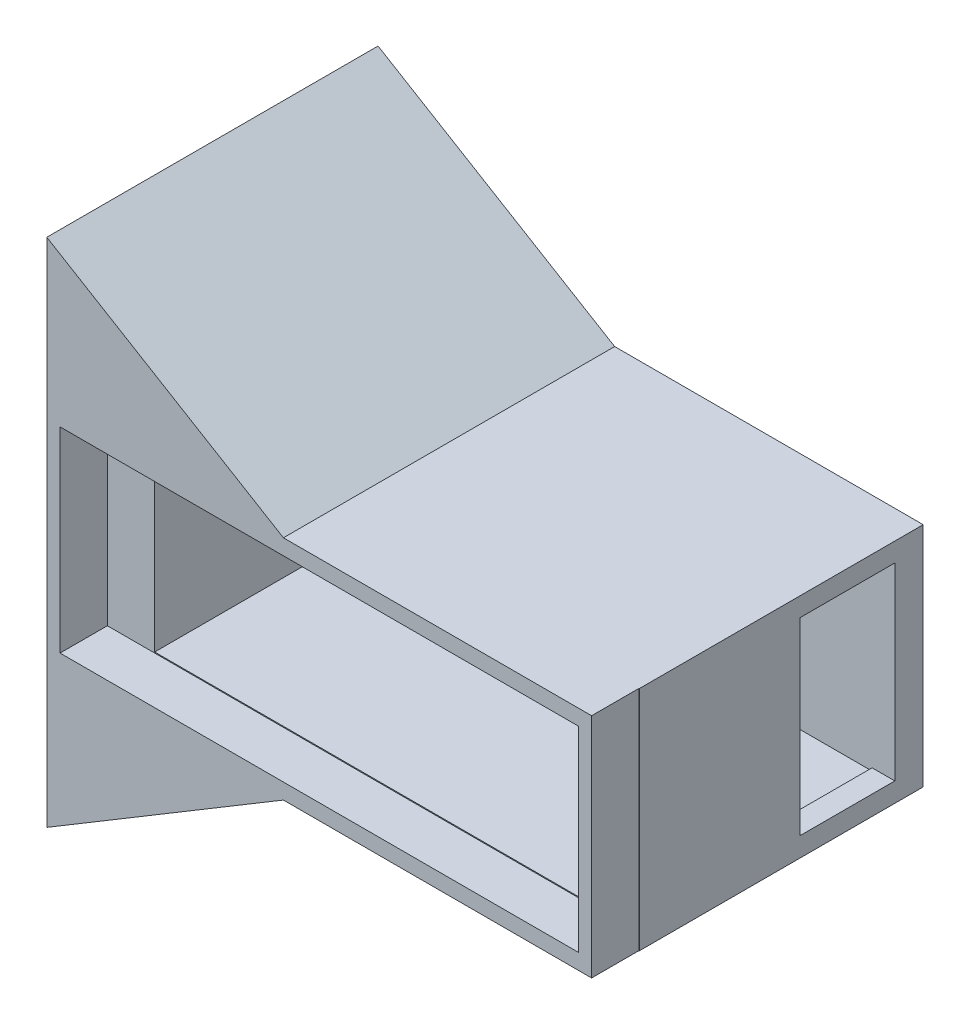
ISO-10303-21;
HEADER;
FILE_DESCRIPTION(('STEP AP214'),'2;1');
FILE_NAME('part.step','',(''),(''),'','','');
FILE_SCHEMA(('AUTOMOTIVE_DESIGN { 1 0 10303 214 1 1 1 1 }'));
ENDSEC;
DATA;
#1=APPLICATION_CONTEXT('core data for automotive mechanical design processes');
#2=APPLICATION_PROTOCOL_DEFINITION('international standard','automotive_design',2000,#1);
#3=PRODUCT_CONTEXT('',#1,'mechanical');
#4=PRODUCT('Part','Part','',(#3));
#5=PRODUCT_RELATED_PRODUCT_CATEGORY('part','',(#4));
#6=PRODUCT_DEFINITION_FORMATION('','',#4);
#7=PRODUCT_DEFINITION_CONTEXT('part definition',#1,'design');
#8=PRODUCT_DEFINITION('design','',#6,#7);
#9=PRODUCT_DEFINITION_SHAPE('','',#8);
#10=(LENGTH_UNIT() NAMED_UNIT(*) SI_UNIT(.MILLI.,.METRE.));
#11=(NAMED_UNIT(*) PLANE_ANGLE_UNIT() SI_UNIT($,.RADIAN.));
#12=(NAMED_UNIT(*) SI_UNIT($,.STERADIAN.) SOLID_ANGLE_UNIT());
#13=UNCERTAINTY_MEASURE_WITH_UNIT(LENGTH_MEASURE(1.E-05),#10,'distance_accuracy_value','');
#14=(GEOMETRIC_REPRESENTATION_CONTEXT(3) GLOBAL_UNCERTAINTY_ASSIGNED_CONTEXT((#13)) GLOBAL_UNIT_ASSIGNED_CONTEXT((#10,
#11,#12)) REPRESENTATION_CONTEXT('',''));
#15=CARTESIAN_POINT('',(0.,0.,0.));
#16=DIRECTION('',(0.,0.,1.));
#17=DIRECTION('',(1.,0.,0.));
#18=AXIS2_PLACEMENT_3D('',#15,#16,#17);
#19=CARTESIAN_POINT('',(-28.8,12.,30.));
#20=DIRECTION('',(0.,-1.,0.));
#21=DIRECTION('',(1.,0.,0.));
#22=AXIS2_PLACEMENT_3D('',#19,#20,#21);
#23=PLANE('',#22);
#24=DIRECTION('',(0.,0.,-1.));
#25=VECTOR('',#24,1.);
#26=CARTESIAN_POINT('',(-3.8,12.,35.));
#27=LINE('',#26,#25);
#28=CARTESIAN_POINT('',(-3.8,12.,35.));
#29=VERTEX_POINT('',#28);
#30=CARTESIAN_POINT('',(-3.8,12.,0.));
#31=VERTEX_POINT('',#30);
#32=EDGE_CURVE('E60',#29,#31,#27,.T.);
#33=ORIENTED_EDGE('',*,*,#32,.F.);
#34=DIRECTION('',(-1.,0.,0.));
#35=VECTOR('',#34,1.);
#36=CARTESIAN_POINT('',(-28.8,12.,35.));
#37=LINE('',#36,#35);
#38=CARTESIAN_POINT('',(28.7632477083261,12.,35.));
#39=VERTEX_POINT('',#38);
#40=EDGE_CURVE('E194',#39,#29,#37,.T.);
#41=ORIENTED_EDGE('',*,*,#40,.F.);
#42=DIRECTION('',(0.,0.,-1.));
#43=VECTOR('',#42,1.);
#44=CARTESIAN_POINT('',(28.7632477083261,12.,35.));
#45=LINE('',#44,#43);
#46=CARTESIAN_POINT('',(28.7632477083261,12.,30.));
#47=VERTEX_POINT('',#46);
#48=EDGE_CURVE('E324',#39,#47,#45,.T.);
#49=ORIENTED_EDGE('',*,*,#48,.T.);
#50=DIRECTION('',(-1.,0.,0.));
#51=VECTOR('',#50,1.);
#52=CARTESIAN_POINT('',(-28.8,12.,30.));
#53=LINE('',#52,#51);
#54=CARTESIAN_POINT('',(28.8,12.,30.));
#55=VERTEX_POINT('',#54);
#56=EDGE_CURVE('E370',#55,#47,#53,.T.);
#57=ORIENTED_EDGE('',*,*,#56,.F.);
#58=DIRECTION('',(0.,0.,-1.));
#59=VECTOR('',#58,1.);
#60=CARTESIAN_POINT('',(28.8,12.,30.));
#61=LINE('',#60,#59);
#62=CARTESIAN_POINT('',(28.8,12.,0.));
#63=VERTEX_POINT('',#62);
#64=EDGE_CURVE('E53',#55,#63,#61,.T.);
#65=ORIENTED_EDGE('',*,*,#64,.T.);
#66=DIRECTION('',(-1.,0.,0.));
#67=VECTOR('',#66,1.);
#68=CARTESIAN_POINT('',(-28.8,12.,0.));
#69=LINE('',#68,#67);
#70=EDGE_CURVE('E381',#63,#31,#69,.T.);
#71=ORIENTED_EDGE('',*,*,#70,.T.);
#72=EDGE_LOOP('',(#33,#41,#49,#57,#65,#71));
#73=FACE_BOUND('',#72,.T.);
#74=ADVANCED_FACE('F44',(#73),#23,.F.);
#75=CARTESIAN_POINT('',(0.0882889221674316,-9.94817546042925,3.));
#76=DIRECTION('',(0.,-1.,0.));
#77=DIRECTION('',(1.,0.,0.));
#78=AXIS2_PLACEMENT_3D('',#75,#76,#77);
#79=PLANE('',#78);
#80=DIRECTION('',(0.,0.,-1.));
#81=VECTOR('',#80,1.);
#82=CARTESIAN_POINT('',(26.4,-9.94817546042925,3.));
#83=LINE('',#82,#81);
#84=CARTESIAN_POINT('',(26.4,-9.94817546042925,13.));
#85=VERTEX_POINT('',#84);
#86=CARTESIAN_POINT('',(26.4,-9.94817546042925,3.));
#87=VERTEX_POINT('',#86);
#88=EDGE_CURVE('E241',#85,#87,#83,.T.);
#89=ORIENTED_EDGE('',*,*,#88,.F.);
#90=DIRECTION('',(1.,0.,0.));
#91=VECTOR('',#90,1.);
#92=CARTESIAN_POINT('',(0.0882889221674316,-9.94817546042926,13.));
#93=LINE('',#92,#91);
#94=CARTESIAN_POINT('',(28.8,-9.94817546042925,13.));
#95=VERTEX_POINT('',#94);
#96=EDGE_CURVE('E261',#85,#95,#93,.T.);
#97=ORIENTED_EDGE('',*,*,#96,.T.);
#98=DIRECTION('',(0.,0.,-1.));
#99=VECTOR('',#98,1.);
#100=CARTESIAN_POINT('',(28.8,-9.94817546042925,3.));
#101=LINE('',#100,#99);
#102=CARTESIAN_POINT('',(28.8,-9.94817546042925,3.));
#103=VERTEX_POINT('',#102);
#104=EDGE_CURVE('E244',#95,#103,#101,.T.);
#105=ORIENTED_EDGE('',*,*,#104,.T.);
#106=DIRECTION('',(1.,0.,0.));
#107=VECTOR('',#106,1.);
#108=CARTESIAN_POINT('',(0.0882889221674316,-9.94817546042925,3.));
#109=LINE('',#108,#107);
#110=EDGE_CURVE('E260',#87,#103,#109,.T.);
#111=ORIENTED_EDGE('',*,*,#110,.F.);
#112=EDGE_LOOP('',(#89,#97,#105,#111));
#113=FACE_BOUND('',#112,.T.);
#114=ADVANCED_FACE('F425',(#113),#79,.F.);
#115=CARTESIAN_POINT('',(0.0882889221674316,-9.94817546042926,13.));
#116=DIRECTION('',(0.,0.,1.));
#117=DIRECTION('',(1.,0.,0.));
#118=AXIS2_PLACEMENT_3D('',#115,#116,#117);
#119=PLANE('',#118);
#120=DIRECTION('',(0.,-1.,0.));
#121=VECTOR('',#120,1.);
#122=CARTESIAN_POINT('',(26.4,-9.94817546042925,13.));
#123=LINE('',#122,#121);
#124=CARTESIAN_POINT('',(26.4,9.99706084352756,13.));
#125=VERTEX_POINT('',#124);
#126=EDGE_CURVE('E235',#125,#85,#123,.T.);
#127=ORIENTED_EDGE('',*,*,#126,.F.);
#128=DIRECTION('',(1.,0.,0.));
#129=VECTOR('',#128,1.);
#130=CARTESIAN_POINT('',(0.0882889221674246,9.99706084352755,13.));
#131=LINE('',#130,#129);
#132=CARTESIAN_POINT('',(28.8,9.99706084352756,13.));
#133=VERTEX_POINT('',#132);
#134=EDGE_CURVE('E265',#125,#133,#131,.T.);
#135=ORIENTED_EDGE('',*,*,#134,.T.);
#136=DIRECTION('',(0.,-1.,0.));
#137=VECTOR('',#136,1.);
#138=CARTESIAN_POINT('',(28.8,-9.94817546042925,13.));
#139=LINE('',#138,#137);
#140=EDGE_CURVE('E256',#133,#95,#139,.T.);
#141=ORIENTED_EDGE('',*,*,#140,.T.);
#142=ORIENTED_EDGE('',*,*,#96,.F.);
#143=EDGE_LOOP('',(#127,#135,#141,#142));
#144=FACE_BOUND('',#143,.T.);
#145=ADVANCED_FACE('F431',(#144),#119,.F.);
#146=CARTESIAN_POINT('',(0.0882889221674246,9.99706084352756,3.));
#147=DIRECTION('',(0.,1.,0.));
#148=DIRECTION('',(0.,0.,1.));
#149=AXIS2_PLACEMENT_3D('',#146,#147,#148);
#150=PLANE('',#149);
#151=DIRECTION('',(0.,0.,1.));
#152=VECTOR('',#151,1.);
#153=CARTESIAN_POINT('',(26.4,9.99706084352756,3.));
#154=LINE('',#153,#152);
#155=CARTESIAN_POINT('',(26.4,9.99706084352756,3.));
#156=VERTEX_POINT('',#155);
#157=EDGE_CURVE('E11',#156,#125,#154,.T.);
#158=ORIENTED_EDGE('',*,*,#157,.F.);
#159=DIRECTION('',(1.,0.,0.));
#160=VECTOR('',#159,1.);
#161=CARTESIAN_POINT('',(0.0882889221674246,9.99706084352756,3.));
#162=LINE('',#161,#160);
#163=CARTESIAN_POINT('',(28.8,9.99706084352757,3.));
#164=VERTEX_POINT('',#163);
#165=EDGE_CURVE('E268',#156,#164,#162,.T.);
#166=ORIENTED_EDGE('',*,*,#165,.T.);
#167=DIRECTION('',(0.,0.,1.));
#168=VECTOR('',#167,1.);
#169=CARTESIAN_POINT('',(28.8,9.99706084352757,3.));
#170=LINE('',#169,#168);
#171=EDGE_CURVE('E252',#164,#133,#170,.T.);
#172=ORIENTED_EDGE('',*,*,#171,.T.);
#173=ORIENTED_EDGE('',*,*,#134,.F.);
#174=EDGE_LOOP('',(#158,#166,#172,#173));
#175=FACE_BOUND('',#174,.T.);
#176=ADVANCED_FACE('F438',(#175),#150,.F.);
#177=CARTESIAN_POINT('',(28.8,12.,30.));
#178=DIRECTION('',(-1.,0.,0.));
#179=DIRECTION('',(0.,-1.,0.));
#180=AXIS2_PLACEMENT_3D('',#177,#178,#179);
#181=PLANE('',#180);
#182=DIRECTION('',(0.,1.,0.));
#183=VECTOR('',#182,1.);
#184=CARTESIAN_POINT('',(28.8,-0.00293915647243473,3.));
#185=LINE('',#184,#183);
#186=EDGE_CURVE('E248',#103,#164,#185,.T.);
#187=ORIENTED_EDGE('',*,*,#186,.F.);
#188=ORIENTED_EDGE('',*,*,#104,.F.);
#189=ORIENTED_EDGE('',*,*,#140,.F.);
#190=ORIENTED_EDGE('',*,*,#171,.F.);
#191=EDGE_LOOP('',(#187,#188,#189,#190));
#192=FACE_BOUND('',#191,.T.);
#193=DIRECTION('',(0.,1.,0.));
#194=VECTOR('',#193,1.);
#195=CARTESIAN_POINT('',(28.8,12.,0.));
#196=LINE('',#195,#194);
#197=CARTESIAN_POINT('',(28.8,-12.,0.));
#198=VERTEX_POINT('',#197);
#199=EDGE_CURVE('E362',#198,#63,#196,.T.);
#200=ORIENTED_EDGE('',*,*,#199,.T.);
#201=ORIENTED_EDGE('',*,*,#64,.F.);
#202=DIRECTION('',(0.,1.,0.));
#203=VECTOR('',#202,1.);
#204=CARTESIAN_POINT('',(28.8,12.,30.));
#205=LINE('',#204,#203);
#206=CARTESIAN_POINT('',(28.8,-12.,30.));
#207=VERTEX_POINT('',#206);
#208=EDGE_CURVE('E366',#207,#55,#205,.T.);
#209=ORIENTED_EDGE('',*,*,#208,.F.);
#210=DIRECTION('',(0.,0.,-1.));
#211=VECTOR('',#210,1.);
#212=CARTESIAN_POINT('',(28.8,-12.,30.));
#213=LINE('',#212,#211);
#214=EDGE_CURVE('E377',#207,#198,#213,.T.);
#215=ORIENTED_EDGE('',*,*,#214,.T.);
#216=EDGE_LOOP('',(#200,#201,#209,#215));
#217=FACE_BOUND('',#216,.T.);
#218=ADVANCED_FACE('F46',(#192,#217),#181,.F.);
#219=CARTESIAN_POINT('',(-28.8,12.,30.));
#220=DIRECTION('',(1.,0.,0.));
#221=DIRECTION('',(0.,0.,-1.));
#222=AXIS2_PLACEMENT_3D('',#219,#220,#221);
#223=PLANE('',#222);
#224=DIRECTION('',(0.,-1.,0.));
#225=VECTOR('',#224,1.);
#226=CARTESIAN_POINT('',(-28.8,12.,0.));
#227=LINE('',#226,#225);
#228=CARTESIAN_POINT('',(-28.8,27.,0.));
#229=VERTEX_POINT('',#228);
#230=CARTESIAN_POINT('',(-28.8,-27.,0.));
#231=VERTEX_POINT('',#230);
#232=EDGE_CURVE('E384',#229,#231,#227,.T.);
#233=ORIENTED_EDGE('',*,*,#232,.T.);
#234=DIRECTION('',(0.,0.,-1.));
#235=VECTOR('',#234,1.);
#236=CARTESIAN_POINT('',(-28.8,-27.,35.));
#237=LINE('',#236,#235);
#238=CARTESIAN_POINT('',(-28.8,-27.,35.));
#239=VERTEX_POINT('',#238);
#240=EDGE_CURVE('E189',#239,#231,#237,.T.);
#241=ORIENTED_EDGE('',*,*,#240,.F.);
#242=DIRECTION('',(0.,-1.,0.));
#243=VECTOR('',#242,1.);
#244=CARTESIAN_POINT('',(-28.8,12.,35.));
#245=LINE('',#244,#243);
#246=CARTESIAN_POINT('',(-28.8,27.,35.));
#247=VERTEX_POINT('',#246);
#248=EDGE_CURVE('E184',#247,#239,#245,.T.);
#249=ORIENTED_EDGE('',*,*,#248,.F.);
#250=DIRECTION('',(0.,0.,-1.));
#251=VECTOR('',#250,1.);
#252=CARTESIAN_POINT('',(-28.8,27.,35.));
#253=LINE('',#252,#251);
#254=EDGE_CURVE('E188',#247,#229,#253,.T.);
#255=ORIENTED_EDGE('',*,*,#254,.T.);
#256=EDGE_LOOP('',(#233,#241,#249,#255));
#257=FACE_BOUND('',#256,.T.);
#258=ADVANCED_FACE('F186',(#257),#223,.F.);
#259=CARTESIAN_POINT('',(-28.8,-12.,30.));
#260=DIRECTION('',(0.,1.,0.));
#261=DIRECTION('',(0.,0.,1.));
#262=AXIS2_PLACEMENT_3D('',#259,#260,#261);
#263=PLANE('',#262);
#264=DIRECTION('',(1.,0.,0.));
#265=VECTOR('',#264,1.);
#266=CARTESIAN_POINT('',(-28.8,-12.,35.));
#267=LINE('',#266,#265);
#268=CARTESIAN_POINT('',(-3.80000000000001,-12.,35.));
#269=VERTEX_POINT('',#268);
#270=CARTESIAN_POINT('',(28.7632477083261,-12.,35.));
#271=VERTEX_POINT('',#270);
#272=EDGE_CURVE('E193',#269,#271,#267,.T.);
#273=ORIENTED_EDGE('',*,*,#272,.F.);
#274=DIRECTION('',(0.,0.,-1.));
#275=VECTOR('',#274,1.);
#276=CARTESIAN_POINT('',(-3.80000000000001,-12.,35.));
#277=LINE('',#276,#275);
#278=CARTESIAN_POINT('',(-3.80000000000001,-12.,0.));
#279=VERTEX_POINT('',#278);
#280=EDGE_CURVE('E215',#269,#279,#277,.T.);
#281=ORIENTED_EDGE('',*,*,#280,.T.);
#282=DIRECTION('',(1.,0.,0.));
#283=VECTOR('',#282,1.);
#284=CARTESIAN_POINT('',(-28.8,-12.,0.));
#285=LINE('',#284,#283);
#286=EDGE_CURVE('E371',#279,#198,#285,.T.);
#287=ORIENTED_EDGE('',*,*,#286,.T.);
#288=ORIENTED_EDGE('',*,*,#214,.F.);
#289=DIRECTION('',(1.,0.,0.));
#290=VECTOR('',#289,1.);
#291=CARTESIAN_POINT('',(-28.8,-12.,30.));
#292=LINE('',#291,#290);
#293=CARTESIAN_POINT('',(28.7632477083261,-12.,30.));
#294=VERTEX_POINT('',#293);
#295=EDGE_CURVE('E374',#294,#207,#292,.T.);
#296=ORIENTED_EDGE('',*,*,#295,.F.);
#297=DIRECTION('',(0.,0.,-1.));
#298=VECTOR('',#297,1.);
#299=CARTESIAN_POINT('',(28.7632477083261,-12.,35.));
#300=LINE('',#299,#298);
#301=EDGE_CURVE('E331',#271,#294,#300,.T.);
#302=ORIENTED_EDGE('',*,*,#301,.F.);
#303=EDGE_LOOP('',(#273,#281,#287,#288,#296,#302));
#304=FACE_BOUND('',#303,.T.);
#305=ADVANCED_FACE('F409',(#304),#263,.F.);
#306=CARTESIAN_POINT('',(0.,0.,30.));
#307=DIRECTION('',(0.,0.,1.));
#308=DIRECTION('',(1.,0.,0.));
#309=AXIS2_PLACEMENT_3D('',#306,#307,#308);
#310=PLANE('',#309);
#311=DIRECTION('',(0.,1.,0.));
#312=VECTOR('',#311,1.);
#313=CARTESIAN_POINT('',(28.7632477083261,12.,30.));
#314=LINE('',#313,#312);
#315=EDGE_CURVE('E307',#294,#47,#314,.T.);
#316=ORIENTED_EDGE('',*,*,#315,.F.);
#317=ORIENTED_EDGE('',*,*,#295,.T.);
#318=ORIENTED_EDGE('',*,*,#208,.T.);
#319=ORIENTED_EDGE('',*,*,#56,.T.);
#320=EDGE_LOOP('',(#316,#317,#318,#319));
#321=FACE_BOUND('',#320,.T.);
#322=ADVANCED_FACE('F413',(#321),#310,.T.);
#323=CARTESIAN_POINT('',(0.,0.,0.));
#324=DIRECTION('',(0.,0.,1.));
#325=DIRECTION('',(1.,0.,0.));
#326=AXIS2_PLACEMENT_3D('',#323,#324,#325);
#327=PLANE('',#326);
#328=ORIENTED_EDGE('',*,*,#199,.F.);
#329=ORIENTED_EDGE('',*,*,#286,.F.);
#330=DIRECTION('',(0.857492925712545,0.514495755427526,0.));
#331=VECTOR('',#330,1.);
#332=CARTESIAN_POINT('',(-28.8,-27.,0.));
#333=LINE('',#332,#331);
#334=EDGE_CURVE('E68',#231,#279,#333,.T.);
#335=ORIENTED_EDGE('',*,*,#334,.F.);
#336=ORIENTED_EDGE('',*,*,#232,.F.);
#337=DIRECTION('',(-0.857492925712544,0.514495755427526,0.));
#338=VECTOR('',#337,1.);
#339=CARTESIAN_POINT('',(-28.8,27.,0.));
#340=LINE('',#339,#338);
#341=EDGE_CURVE('E201',#31,#229,#340,.T.);
#342=ORIENTED_EDGE('',*,*,#341,.F.);
#343=ORIENTED_EDGE('',*,*,#70,.F.);
#344=EDGE_LOOP('',(#328,#329,#335,#336,#342,#343));
#345=FACE_BOUND('',#344,.T.);
#346=ADVANCED_FACE('F400',(#345),#327,.F.);
#347=CARTESIAN_POINT('',(0.,0.,35.));
#348=DIRECTION('',(0.,0.,-1.));
#349=DIRECTION('',(-1.,0.,0.));
#350=AXIS2_PLACEMENT_3D('',#347,#348,#349);
#351=PLANE('',#350);
#352=DIRECTION('',(-1.,0.,0.));
#353=VECTOR('',#352,1.);
#354=CARTESIAN_POINT('',(-27.4,10.35,35.));
#355=LINE('',#354,#353);
#356=CARTESIAN_POINT('',(27.4,10.35,35.));
#357=VERTEX_POINT('',#356);
#358=CARTESIAN_POINT('',(-27.4,10.35,35.));
#359=VERTEX_POINT('',#358);
#360=EDGE_CURVE('E293',#357,#359,#355,.T.);
#361=ORIENTED_EDGE('',*,*,#360,.F.);
#362=DIRECTION('',(0.,1.,0.));
#363=VECTOR('',#362,1.);
#364=CARTESIAN_POINT('',(27.4,10.35,35.));
#365=LINE('',#364,#363);
#366=CARTESIAN_POINT('',(27.4,-10.35,35.));
#367=VERTEX_POINT('',#366);
#368=EDGE_CURVE('E264',#367,#357,#365,.T.);
#369=ORIENTED_EDGE('',*,*,#368,.F.);
#370=DIRECTION('',(1.,0.,0.));
#371=VECTOR('',#370,1.);
#372=CARTESIAN_POINT('',(-27.4,-10.35,35.));
#373=LINE('',#372,#371);
#374=CARTESIAN_POINT('',(-27.4,-10.35,35.));
#375=VERTEX_POINT('',#374);
#376=EDGE_CURVE('E278',#375,#367,#373,.T.);
#377=ORIENTED_EDGE('',*,*,#376,.F.);
#378=DIRECTION('',(0.,-1.,0.));
#379=VECTOR('',#378,1.);
#380=CARTESIAN_POINT('',(-27.4,10.35,35.));
#381=LINE('',#380,#379);
#382=EDGE_CURVE('E297',#359,#375,#381,.T.);
#383=ORIENTED_EDGE('',*,*,#382,.F.);
#384=EDGE_LOOP('',(#361,#369,#377,#383));
#385=FACE_BOUND('',#384,.T.);
#386=ORIENTED_EDGE('',*,*,#40,.T.);
#387=DIRECTION('',(-0.857492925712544,0.514495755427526,0.));
#388=VECTOR('',#387,1.);
#389=CARTESIAN_POINT('',(-28.8,27.,35.));
#390=LINE('',#389,#388);
#391=EDGE_CURVE('E197',#29,#247,#390,.T.);
#392=ORIENTED_EDGE('',*,*,#391,.T.);
#393=ORIENTED_EDGE('',*,*,#248,.T.);
#394=DIRECTION('',(0.857492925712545,0.514495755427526,0.));
#395=VECTOR('',#394,1.);
#396=CARTESIAN_POINT('',(-28.8,-27.,35.));
#397=LINE('',#396,#395);
#398=EDGE_CURVE('E218',#239,#269,#397,.T.);
#399=ORIENTED_EDGE('',*,*,#398,.T.);
#400=ORIENTED_EDGE('',*,*,#272,.T.);
#401=DIRECTION('',(0.,1.,0.));
#402=VECTOR('',#401,1.);
#403=CARTESIAN_POINT('',(28.7632477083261,12.,35.));
#404=LINE('',#403,#402);
#405=EDGE_CURVE('E321',#271,#39,#404,.T.);
#406=ORIENTED_EDGE('',*,*,#405,.T.);
#407=EDGE_LOOP('',(#386,#392,#393,#399,#400,#406));
#408=FACE_BOUND('',#407,.T.);
#409=ADVANCED_FACE('F198',(#385,#408),#351,.F.);
#410=CARTESIAN_POINT('',(28.7632477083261,12.,35.));
#411=DIRECTION('',(-1.,0.,0.));
#412=DIRECTION('',(0.,0.,1.));
#413=AXIS2_PLACEMENT_3D('',#410,#411,#412);
#414=PLANE('',#413);
#415=ORIENTED_EDGE('',*,*,#315,.T.);
#416=ORIENTED_EDGE('',*,*,#48,.F.);
#417=ORIENTED_EDGE('',*,*,#405,.F.);
#418=ORIENTED_EDGE('',*,*,#301,.T.);
#419=EDGE_LOOP('',(#415,#416,#417,#418));
#420=FACE_BOUND('',#419,.T.);
#421=ADVANCED_FACE('F411',(#420),#414,.F.);
#422=CARTESIAN_POINT('',(27.4,10.35,30.));
#423=DIRECTION('',(1.,0.,0.));
#424=DIRECTION('',(0.,0.,-1.));
#425=AXIS2_PLACEMENT_3D('',#422,#423,#424);
#426=PLANE('',#425);
#427=ORIENTED_EDGE('',*,*,#368,.T.);
#428=DIRECTION('',(0.,0.,1.));
#429=VECTOR('',#428,1.);
#430=CARTESIAN_POINT('',(27.4,10.35,30.));
#431=LINE('',#430,#429);
#432=CARTESIAN_POINT('',(27.4,10.35,30.));
#433=VERTEX_POINT('',#432);
#434=EDGE_CURVE('E290',#433,#357,#431,.T.);
#435=ORIENTED_EDGE('',*,*,#434,.F.);
#436=DIRECTION('',(0.,1.,0.));
#437=VECTOR('',#436,1.);
#438=CARTESIAN_POINT('',(27.4,10.35,30.));
#439=LINE('',#438,#437);
#440=CARTESIAN_POINT('',(27.4,-10.35,30.));
#441=VERTEX_POINT('',#440);
#442=EDGE_CURVE('E273',#441,#433,#439,.T.);
#443=ORIENTED_EDGE('',*,*,#442,.F.);
#444=DIRECTION('',(0.,0.,1.));
#445=VECTOR('',#444,1.);
#446=CARTESIAN_POINT('',(27.4,-10.35,30.));
#447=LINE('',#446,#445);
#448=EDGE_CURVE('E304',#441,#367,#447,.T.);
#449=ORIENTED_EDGE('',*,*,#448,.T.);
#450=EDGE_LOOP('',(#427,#435,#443,#449));
#451=FACE_BOUND('',#450,.T.);
#452=ADVANCED_FACE('F487',(#451),#426,.F.);
#453=CARTESIAN_POINT('',(-27.4,-10.35,30.));
#454=DIRECTION('',(0.,-1.,0.));
#455=DIRECTION('',(0.,0.,-1.));
#456=AXIS2_PLACEMENT_3D('',#453,#454,#455);
#457=PLANE('',#456);
#458=ORIENTED_EDGE('',*,*,#376,.T.);
#459=ORIENTED_EDGE('',*,*,#448,.F.);
#460=DIRECTION('',(1.,0.,0.));
#461=VECTOR('',#460,1.);
#462=CARTESIAN_POINT('',(-27.4,-10.35,30.));
#463=LINE('',#462,#461);
#464=CARTESIAN_POINT('',(-27.4,-10.35,30.));
#465=VERTEX_POINT('',#464);
#466=EDGE_CURVE('E286',#465,#441,#463,.T.);
#467=ORIENTED_EDGE('',*,*,#466,.F.);
#468=DIRECTION('',(0.,0.,1.));
#469=VECTOR('',#468,1.);
#470=CARTESIAN_POINT('',(-27.4,-10.35,30.));
#471=LINE('',#470,#469);
#472=EDGE_CURVE('E308',#465,#375,#471,.T.);
#473=ORIENTED_EDGE('',*,*,#472,.T.);
#474=EDGE_LOOP('',(#458,#459,#467,#473));
#475=FACE_BOUND('',#474,.T.);
#476=ADVANCED_FACE('F496',(#475),#457,.F.);
#477=CARTESIAN_POINT('',(-27.4,10.35,30.));
#478=DIRECTION('',(-1.,0.,0.));
#479=DIRECTION('',(0.,-1.,0.));
#480=AXIS2_PLACEMENT_3D('',#477,#478,#479);
#481=PLANE('',#480);
#482=ORIENTED_EDGE('',*,*,#382,.T.);
#483=ORIENTED_EDGE('',*,*,#472,.F.);
#484=DIRECTION('',(0.,-1.,0.));
#485=VECTOR('',#484,1.);
#486=CARTESIAN_POINT('',(-27.4,10.35,30.));
#487=LINE('',#486,#485);
#488=CARTESIAN_POINT('',(-27.4,10.35,30.));
#489=VERTEX_POINT('',#488);
#490=EDGE_CURVE('E282',#489,#465,#487,.T.);
#491=ORIENTED_EDGE('',*,*,#490,.F.);
#492=DIRECTION('',(0.,0.,1.));
#493=VECTOR('',#492,1.);
#494=CARTESIAN_POINT('',(-27.4,10.35,30.));
#495=LINE('',#494,#493);
#496=EDGE_CURVE('E311',#489,#359,#495,.T.);
#497=ORIENTED_EDGE('',*,*,#496,.T.);
#498=EDGE_LOOP('',(#482,#483,#491,#497));
#499=FACE_BOUND('',#498,.T.);
#500=ADVANCED_FACE('F494',(#499),#481,.F.);
#501=CARTESIAN_POINT('',(-27.4,10.35,30.));
#502=DIRECTION('',(0.,1.,0.));
#503=DIRECTION('',(0.,0.,1.));
#504=AXIS2_PLACEMENT_3D('',#501,#502,#503);
#505=PLANE('',#504);
#506=ORIENTED_EDGE('',*,*,#360,.T.);
#507=ORIENTED_EDGE('',*,*,#496,.F.);
#508=DIRECTION('',(-1.,0.,0.));
#509=VECTOR('',#508,1.);
#510=CARTESIAN_POINT('',(-27.4,10.35,30.));
#511=LINE('',#510,#509);
#512=EDGE_CURVE('E277',#433,#489,#511,.T.);
#513=ORIENTED_EDGE('',*,*,#512,.F.);
#514=ORIENTED_EDGE('',*,*,#434,.T.);
#515=EDGE_LOOP('',(#506,#507,#513,#514));
#516=FACE_BOUND('',#515,.T.);
#517=ADVANCED_FACE('F481',(#516),#505,.F.);
#518=CARTESIAN_POINT('',(0.,0.,30.));
#519=DIRECTION('',(0.,0.,1.));
#520=DIRECTION('',(1.,0.,0.));
#521=AXIS2_PLACEMENT_3D('',#518,#519,#520);
#522=PLANE('',#521);
#523=DIRECTION('',(-1.,0.,0.));
#524=VECTOR('',#523,1.);
#525=CARTESIAN_POINT('',(-22.4,10.25,30.));
#526=LINE('',#525,#524);
#527=CARTESIAN_POINT('',(26.4,10.25,30.));
#528=VERTEX_POINT('',#527);
#529=CARTESIAN_POINT('',(-22.4,10.25,30.));
#530=VERTEX_POINT('',#529);
#531=EDGE_CURVE('E335',#528,#530,#526,.T.);
#532=ORIENTED_EDGE('',*,*,#531,.F.);
#533=DIRECTION('',(0.,-1.,0.));
#534=VECTOR('',#533,1.);
#535=CARTESIAN_POINT('',(26.4,10.25,30.));
#536=LINE('',#535,#534);
#537=CARTESIAN_POINT('',(26.4,-10.25,30.));
#538=VERTEX_POINT('',#537);
#539=EDGE_CURVE('E209',#528,#538,#536,.T.);
#540=ORIENTED_EDGE('',*,*,#539,.T.);
#541=DIRECTION('',(1.,0.,0.));
#542=VECTOR('',#541,1.);
#543=CARTESIAN_POINT('',(-22.4,-10.25,30.));
#544=LINE('',#543,#542);
#545=CARTESIAN_POINT('',(-22.4,-10.25,30.));
#546=VERTEX_POINT('',#545);
#547=EDGE_CURVE('E341',#546,#538,#544,.T.);
#548=ORIENTED_EDGE('',*,*,#547,.F.);
#549=DIRECTION('',(0.,-1.,0.));
#550=VECTOR('',#549,1.);
#551=CARTESIAN_POINT('',(-22.4,10.25,30.));
#552=LINE('',#551,#550);
#553=EDGE_CURVE('E352',#530,#546,#552,.T.);
#554=ORIENTED_EDGE('',*,*,#553,.F.);
#555=EDGE_LOOP('',(#532,#540,#548,#554));
#556=FACE_BOUND('',#555,.T.);
#557=ORIENTED_EDGE('',*,*,#442,.T.);
#558=ORIENTED_EDGE('',*,*,#512,.T.);
#559=ORIENTED_EDGE('',*,*,#490,.T.);
#560=ORIENTED_EDGE('',*,*,#466,.T.);
#561=EDGE_LOOP('',(#557,#558,#559,#560));
#562=FACE_BOUND('',#561,.T.);
#563=ADVANCED_FACE('F478',(#556,#562),#522,.T.);
#564=CARTESIAN_POINT('',(0.,0.,3.));
#565=DIRECTION('',(0.,0.,1.));
#566=DIRECTION('',(1.,0.,0.));
#567=AXIS2_PLACEMENT_3D('',#564,#565,#566);
#568=PLANE('',#567);
#569=DIRECTION('',(0.,-1.,0.));
#570=VECTOR('',#569,1.);
#571=CARTESIAN_POINT('',(26.4,10.25,3.));
#572=LINE('',#571,#570);
#573=CARTESIAN_POINT('',(26.4,10.25,3.));
#574=VERTEX_POINT('',#573);
#575=EDGE_CURVE('E223',#574,#156,#572,.T.);
#576=ORIENTED_EDGE('',*,*,#575,.F.);
#577=DIRECTION('',(-1.,0.,0.));
#578=VECTOR('',#577,1.);
#579=CARTESIAN_POINT('',(-22.4,10.25,3.));
#580=LINE('',#579,#578);
#581=CARTESIAN_POINT('',(-22.4,10.25,3.));
#582=VERTEX_POINT('',#581);
#583=EDGE_CURVE('E336',#574,#582,#580,.T.);
#584=ORIENTED_EDGE('',*,*,#583,.T.);
#585=DIRECTION('',(0.,-1.,0.));
#586=VECTOR('',#585,1.);
#587=CARTESIAN_POINT('',(-22.4,10.25,3.));
#588=LINE('',#587,#586);
#589=CARTESIAN_POINT('',(-22.4,-10.25,3.));
#590=VERTEX_POINT('',#589);
#591=EDGE_CURVE('E340',#582,#590,#588,.T.);
#592=ORIENTED_EDGE('',*,*,#591,.T.);
#593=DIRECTION('',(1.,0.,0.));
#594=VECTOR('',#593,1.);
#595=CARTESIAN_POINT('',(-22.4,-10.25,3.));
#596=LINE('',#595,#594);
#597=CARTESIAN_POINT('',(26.4,-10.25,3.));
#598=VERTEX_POINT('',#597);
#599=EDGE_CURVE('E345',#590,#598,#596,.T.);
#600=ORIENTED_EDGE('',*,*,#599,.T.);
#601=EDGE_CURVE('E227',#87,#598,#572,.T.);
#602=ORIENTED_EDGE('',*,*,#601,.F.);
#603=ORIENTED_EDGE('',*,*,#110,.T.);
#604=ORIENTED_EDGE('',*,*,#186,.T.);
#605=ORIENTED_EDGE('',*,*,#165,.F.);
#606=EDGE_LOOP('',(#576,#584,#592,#600,#602,#603,#604,#605));
#607=FACE_BOUND('',#606,.T.);
#608=ADVANCED_FACE('F453',(#607),#568,.T.);
#609=CARTESIAN_POINT('',(-22.4,10.25,3.));
#610=DIRECTION('',(0.,1.,0.));
#611=DIRECTION('',(0.,0.,1.));
#612=AXIS2_PLACEMENT_3D('',#609,#610,#611);
#613=PLANE('',#612);
#614=ORIENTED_EDGE('',*,*,#531,.T.);
#615=DIRECTION('',(0.,0.,1.));
#616=VECTOR('',#615,1.);
#617=CARTESIAN_POINT('',(-22.4,10.25,3.));
#618=LINE('',#617,#616);
#619=EDGE_CURVE('E348',#582,#530,#618,.T.);
#620=ORIENTED_EDGE('',*,*,#619,.F.);
#621=ORIENTED_EDGE('',*,*,#583,.F.);
#622=DIRECTION('',(0.,0.,1.));
#623=VECTOR('',#622,1.);
#624=CARTESIAN_POINT('',(26.4,10.25,3.));
#625=LINE('',#624,#623);
#626=EDGE_CURVE('E231',#574,#528,#625,.T.);
#627=ORIENTED_EDGE('',*,*,#626,.T.);
#628=EDGE_LOOP('',(#614,#620,#621,#627));
#629=FACE_BOUND('',#628,.T.);
#630=ADVANCED_FACE('F470',(#629),#613,.F.);
#631=CARTESIAN_POINT('',(-22.4,10.25,3.));
#632=DIRECTION('',(-1.,0.,0.));
#633=DIRECTION('',(0.,0.,1.));
#634=AXIS2_PLACEMENT_3D('',#631,#632,#633);
#635=PLANE('',#634);
#636=ORIENTED_EDGE('',*,*,#553,.T.);
#637=DIRECTION('',(0.,0.,1.));
#638=VECTOR('',#637,1.);
#639=CARTESIAN_POINT('',(-22.4,-10.25,3.));
#640=LINE('',#639,#638);
#641=EDGE_CURVE('E358',#590,#546,#640,.T.);
#642=ORIENTED_EDGE('',*,*,#641,.F.);
#643=ORIENTED_EDGE('',*,*,#591,.F.);
#644=ORIENTED_EDGE('',*,*,#619,.T.);
#645=EDGE_LOOP('',(#636,#642,#643,#644));
#646=FACE_BOUND('',#645,.T.);
#647=ADVANCED_FACE('F472',(#646),#635,.F.);
#648=CARTESIAN_POINT('',(-22.4,-10.25,3.));
#649=DIRECTION('',(0.,-1.,0.));
#650=DIRECTION('',(0.,0.,-1.));
#651=AXIS2_PLACEMENT_3D('',#648,#649,#650);
#652=PLANE('',#651);
#653=ORIENTED_EDGE('',*,*,#547,.T.);
#654=DIRECTION('',(0.,0.,1.));
#655=VECTOR('',#654,1.);
#656=CARTESIAN_POINT('',(26.4,-10.25,3.));
#657=LINE('',#656,#655);
#658=EDGE_CURVE('E226',#598,#538,#657,.T.);
#659=ORIENTED_EDGE('',*,*,#658,.F.);
#660=ORIENTED_EDGE('',*,*,#599,.F.);
#661=ORIENTED_EDGE('',*,*,#641,.T.);
#662=EDGE_LOOP('',(#653,#659,#660,#661));
#663=FACE_BOUND('',#662,.T.);
#664=ADVANCED_FACE('F474',(#663),#652,.F.);
#665=CARTESIAN_POINT('',(26.4,10.25,3.));
#666=DIRECTION('',(-1.,0.,0.));
#667=DIRECTION('',(0.,-1.,0.));
#668=AXIS2_PLACEMENT_3D('',#665,#666,#667);
#669=PLANE('',#668);
#670=ORIENTED_EDGE('',*,*,#88,.T.);
#671=ORIENTED_EDGE('',*,*,#601,.T.);
#672=ORIENTED_EDGE('',*,*,#658,.T.);
#673=ORIENTED_EDGE('',*,*,#539,.F.);
#674=ORIENTED_EDGE('',*,*,#626,.F.);
#675=ORIENTED_EDGE('',*,*,#575,.T.);
#676=ORIENTED_EDGE('',*,*,#157,.T.);
#677=ORIENTED_EDGE('',*,*,#126,.T.);
#678=EDGE_LOOP('',(#670,#671,#672,#673,#674,#675,#676,#677));
#679=FACE_BOUND('',#678,.T.);
#680=ADVANCED_FACE('F464',(#679),#669,.T.);
#681=CARTESIAN_POINT('',(-28.8,-27.,35.));
#682=DIRECTION('',(-0.514495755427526,0.857492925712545,0.));
#683=DIRECTION('',(-0.857492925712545,-0.514495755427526,0.));
#684=AXIS2_PLACEMENT_3D('',#681,#682,#683);
#685=PLANE('',#684);
#686=ORIENTED_EDGE('',*,*,#334,.T.);
#687=ORIENTED_EDGE('',*,*,#280,.F.);
#688=ORIENTED_EDGE('',*,*,#398,.F.);
#689=ORIENTED_EDGE('',*,*,#240,.T.);
#690=EDGE_LOOP('',(#686,#687,#688,#689));
#691=FACE_BOUND('',#690,.T.);
#692=ADVANCED_FACE('F402',(#691),#685,.F.);
#693=CARTESIAN_POINT('',(-28.8,27.,35.));
#694=DIRECTION('',(-0.514495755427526,-0.857492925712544,0.));
#695=DIRECTION('',(0.857492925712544,-0.514495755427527,0.));
#696=AXIS2_PLACEMENT_3D('',#693,#694,#695);
#697=PLANE('',#696);
#698=ORIENTED_EDGE('',*,*,#341,.T.);
#699=ORIENTED_EDGE('',*,*,#254,.F.);
#700=ORIENTED_EDGE('',*,*,#391,.F.);
#701=ORIENTED_EDGE('',*,*,#32,.T.);
#702=EDGE_LOOP('',(#698,#699,#700,#701));
#703=FACE_BOUND('',#702,.T.);
#704=ADVANCED_FACE('F204',(#703),#697,.F.);
#705=CLOSED_SHELL('',(#74,#114,#145,#176,#218,#258,#305,#322,#346,#409,#421,#452,#476,#500,#517,
#563,#608,#630,#647,#664,#680,#692,#704));
#706=MANIFOLD_SOLID_BREP('B2',#705);
#707=ADVANCED_BREP_SHAPE_REPRESENTATION('',(#18,#706),#14);
#708=SHAPE_DEFINITION_REPRESENTATION(#9,#707);
ENDSEC;
END-ISO-10303-21;
